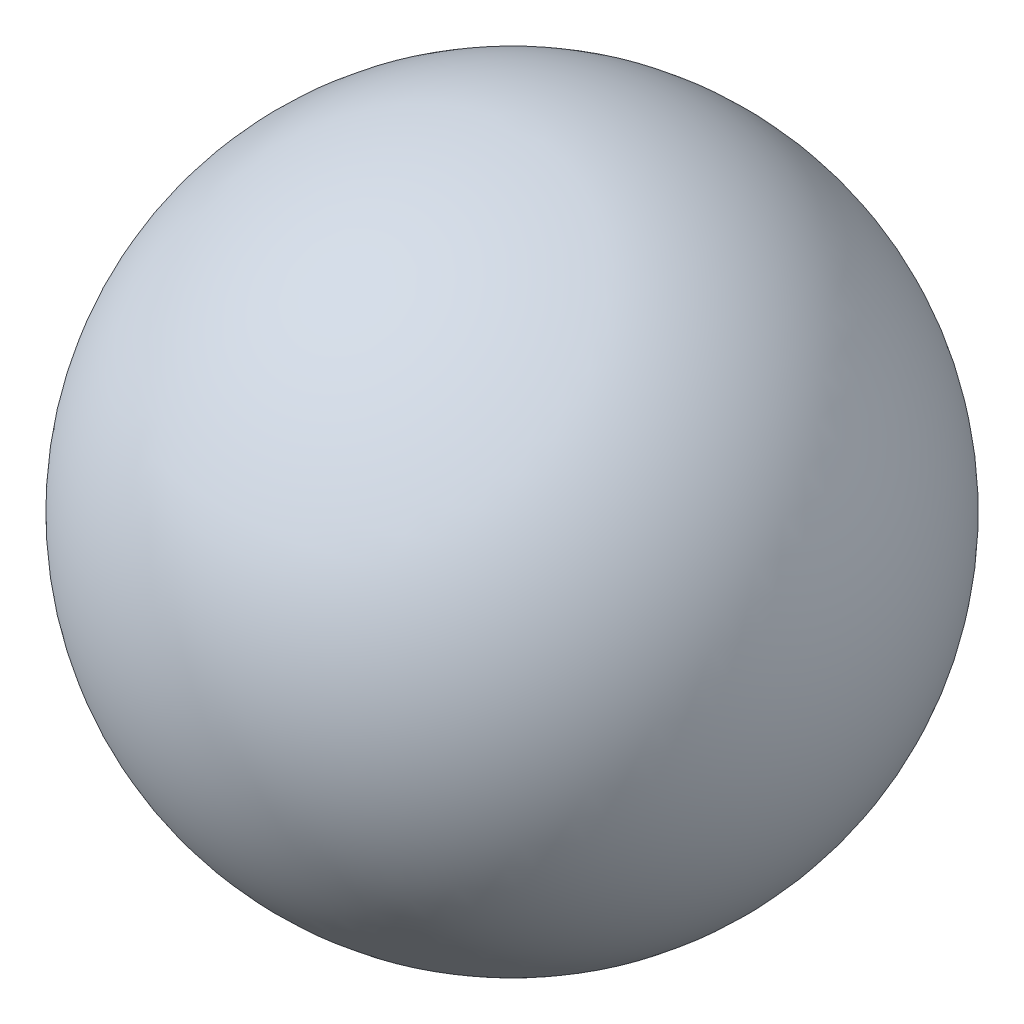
ISO-10303-21;
HEADER;
FILE_DESCRIPTION(('STEP AP214'),'2;1');
FILE_NAME('part.step','',(''),(''),'','','');
FILE_SCHEMA(('AUTOMOTIVE_DESIGN { 1 0 10303 214 1 1 1 1 }'));
ENDSEC;
DATA;
#1=APPLICATION_CONTEXT('core data for automotive mechanical design processes');
#2=APPLICATION_PROTOCOL_DEFINITION('international standard','automotive_design',2000,#1);
#3=PRODUCT_CONTEXT('',#1,'mechanical');
#4=PRODUCT('Part','Part','',(#3));
#5=PRODUCT_RELATED_PRODUCT_CATEGORY('part','',(#4));
#6=PRODUCT_DEFINITION_FORMATION('','',#4);
#7=PRODUCT_DEFINITION_CONTEXT('part definition',#1,'design');
#8=PRODUCT_DEFINITION('design','',#6,#7);
#9=PRODUCT_DEFINITION_SHAPE('','',#8);
#10=(LENGTH_UNIT() NAMED_UNIT(*) SI_UNIT(.MILLI.,.METRE.));
#11=(NAMED_UNIT(*) PLANE_ANGLE_UNIT() SI_UNIT($,.RADIAN.));
#12=(NAMED_UNIT(*) SI_UNIT($,.STERADIAN.) SOLID_ANGLE_UNIT());
#13=UNCERTAINTY_MEASURE_WITH_UNIT(LENGTH_MEASURE(1.E-05),#10,'distance_accuracy_value','');
#14=(GEOMETRIC_REPRESENTATION_CONTEXT(3) GLOBAL_UNCERTAINTY_ASSIGNED_CONTEXT((#13)) GLOBAL_UNIT_ASSIGNED_CONTEXT((#10,
#11,#12)) REPRESENTATION_CONTEXT('',''));
#15=CARTESIAN_POINT('',(0.,0.,0.));
#16=DIRECTION('',(0.,0.,1.));
#17=DIRECTION('',(1.,0.,0.));
#18=AXIS2_PLACEMENT_3D('',#15,#16,#17);
#19=CARTESIAN_POINT('',(0.,0.,0.));
#20=DIRECTION('',(0.,1.,0.));
#21=DIRECTION('',(1.,0.,0.));
#22=AXIS2_PLACEMENT_3D('',#19,#20,#21);
#23=SPHERICAL_SURFACE('',#22,32.512);
#24=CARTESIAN_POINT('',(0.,32.512,0.));
#25=VERTEX_POINT('',#24);
#26=VERTEX_LOOP('',#25);
#27=FACE_BOUND('',#26,.T.);
#28=ADVANCED_FACE('F27',(#27),#23,.T.);
#29=CLOSED_SHELL('',(#28));
#30=MANIFOLD_SOLID_BREP('B2',#29);
#31=ADVANCED_BREP_SHAPE_REPRESENTATION('',(#18,#30),#14);
#32=SHAPE_DEFINITION_REPRESENTATION(#9,#31);
ENDSEC;
END-ISO-10303-21;
